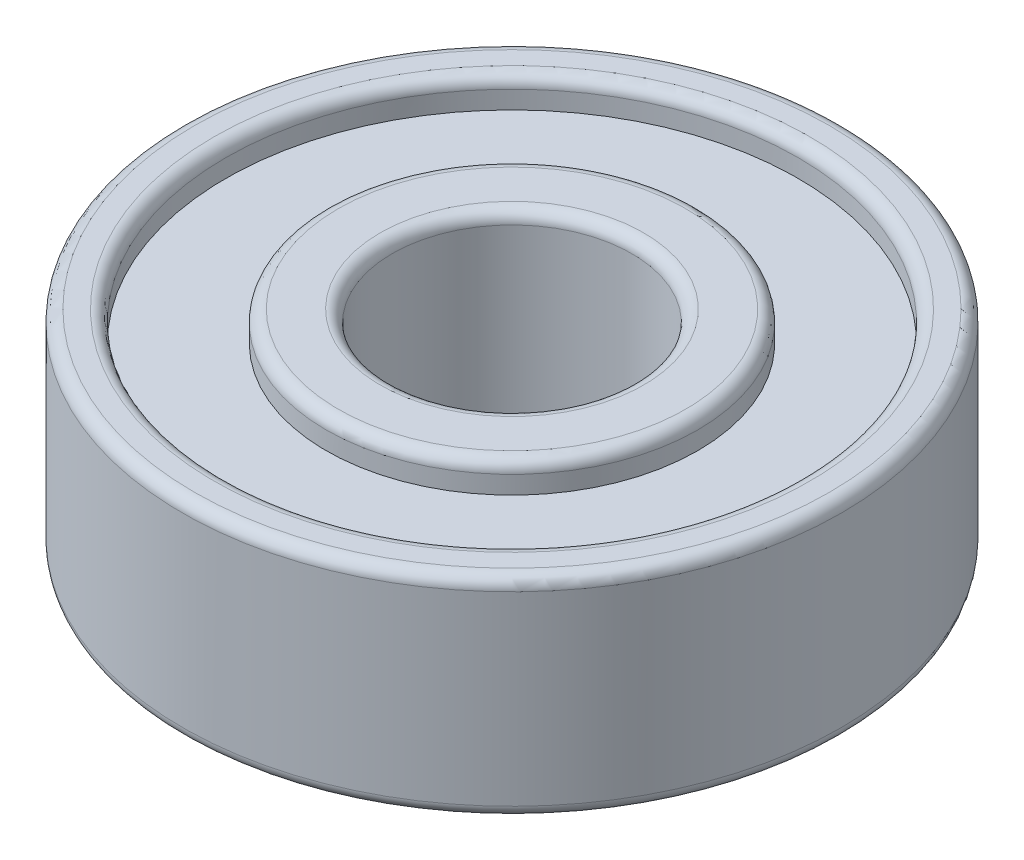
from build123d import *

# Parameters (mm, degrees)
CONG_1_R = 0.4


with BuildPart() as part:
    # Esquisse1 → R_volution1 (revolve)
    with BuildSketch(Plane.XY):
        Polygon((9.55, 0), (11, 0), (11, 7), (9.55, 7), (9.55, 6), (6.2, 6), (6.2, 7), (4, 7), (4, 0), (6.2, 0), (6.2, 1), (9.55, 1), align=None)
    revolve(axis=Axis((0, 0, 0), (0, 1, 0)))

    # Cong_1
    cong_1_edges = [part.edges().sort_by_distance(p)[0] for p in [
        (-9.55, 7, 0),
        (-11, 7, 0),
        (-11, 0, 0),
        (-9.55, 0, 0),
        (-6.2, 0, 0),
        (-4, 0, 0),
        (-4, 7, 0),
        (-6.2, 7, 0),
    ]]
    fillet(cong_1_edges, radius=CONG_1_R)


solid = part.part
